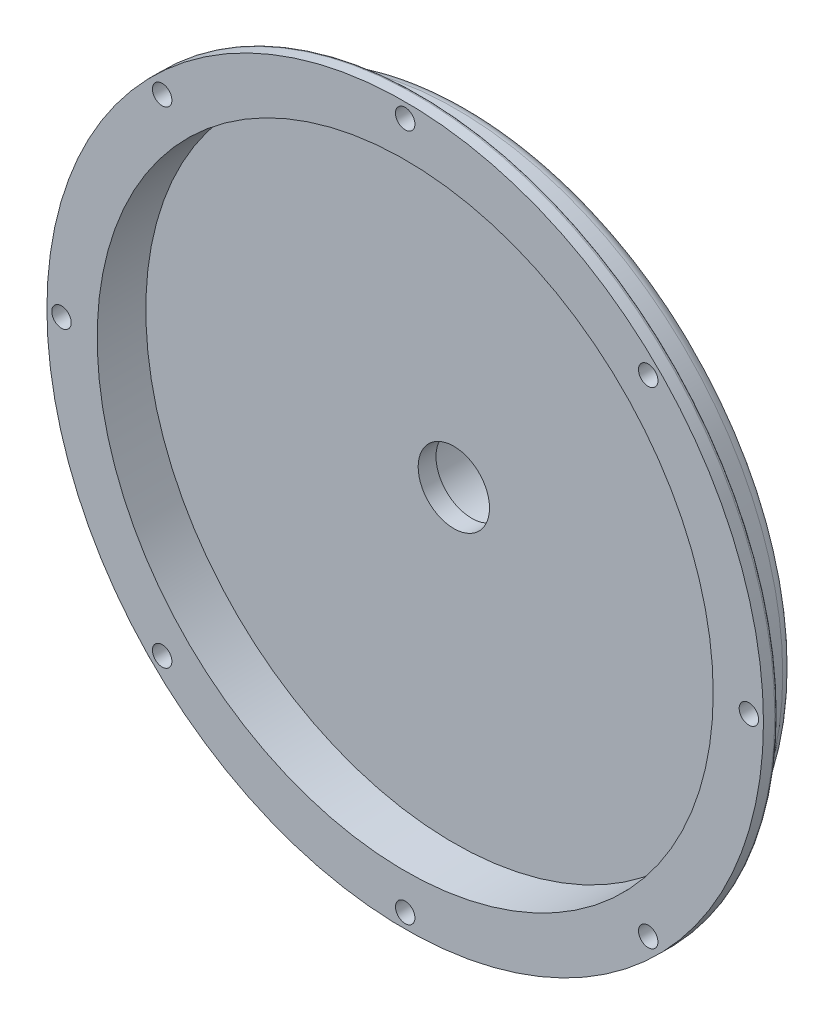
from build123d import *

# Parameters (mm, degrees)
SKETCH_2_R          = 3
CUT_EXTRUDE_1_DEPTH = 10
SKETCH_3_R          = 15
CUT_EXTRUDE_2_DEPTH = 5
EXTRUDE_START       = 14.5
SKETCH_7_R          = 17
SKETCH_7_R_2        = 15
EXTRUDE_1_DEPTH     = 14.5
SKETCH_5_R          = 95
CUT_EXTRUDE_4_DEPTH = 15
SKETCH_6_R          = 11
CUT_EXTRUDE_5_DEPTH = 15
FILLET_1_R          = 1
SKETCH_10_R         = 17.75
SKETCH_10_R_2       = 15.5
EXTRUDE_2_DEPTH     = 13


with BuildPart() as part:
    # Sketch 1 → Revolve 1 (revolve)
    with BuildSketch(Plane(origin=(0, 0, 0), x_dir=(1, 0, 0), z_dir=(0, 1, 0)), mode=Mode.PRIVATE) as revolve_1_sk:
        with BuildLine():
            Line((0, 25.5), (-26.5, 25.5))
            Line((-26.5, 25.5), (-26.5, 22.5))
            ThreePointArc((-26.5, 22.5), (-27.378679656, 20.378679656), (-29.5, 19.5))
            Line((-29.5, 19.5), (-96.637931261, 19.5))
            ThreePointArc((-96.637931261, 19.5), (-99.34998521, 18.440197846), (-100.624918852, 15.822381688))
            Line((-100.624918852, 15.822381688), (-101.46608759, 5.419404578))
            ThreePointArc((-101.46608759, 5.419404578), (-101.784821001, 4.764950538), (-102.462834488, 4.5))
            Line((-102.462834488, 4.5), (-109.5, 4.5))
            ThreePointArc((-109.5, 4.5), (-110.207106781, 4.207106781), (-110.5, 3.5))
            Line((-110.5, 3.5), (-110.5, 0))
            Line((-110.5, 0), (0, 0))
            Line((0, 0), (0, 25.5))
        make_face()
    revolve(revolve_1_sk.sketch.rotate(Axis((0, 0, 0), (0, 0, -1)), 180), axis=Axis((0, 0, 0), (0, 0, -1)))

    # Sketch 2 → Cut-Extrude 1 (cut)
    with BuildSketch(Plane.XY):
        with Locations((0, 106)):
            Circle(SKETCH_2_R)
        with Locations((74.953318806, 74.953318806)):
            Circle(SKETCH_2_R)
        with Locations((106, 0)):
            Circle(SKETCH_2_R)
        with Locations((74.953318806, -74.953318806)):
            Circle(SKETCH_2_R)
        with Locations((0, -106)):
            Circle(SKETCH_2_R)
        with Locations((-74.953318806, -74.953318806)):
            Circle(SKETCH_2_R)
        with Locations((-106, 0)):
            Circle(SKETCH_2_R)
        with Locations((-74.953318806, 74.953318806)):
            Circle(SKETCH_2_R)
    extrude(amount=-CUT_EXTRUDE_1_DEPTH, mode=Mode.SUBTRACT)

    # Sketch 3 → Cut-Extrude 2 (cut)
    with BuildSketch(Plane.XY.offset(-25.5)):
        Circle(SKETCH_3_R)
    extrude(amount=CUT_EXTRUDE_2_DEPTH, mode=Mode.SUBTRACT)

    # Sketch 7 → Extrude 1 (add)
    with BuildSketch(Plane(origin=(0, 0, -25.5), x_dir=(-1, 0, 0), z_dir=(0, 0, -1)).offset(EXTRUDE_START)):
        with Locations(Location((0, 0, 0), (0, 0, 180))):
            Circle(SKETCH_7_R)
        Circle(SKETCH_7_R_2, mode=Mode.SUBTRACT)
    extrude(amount=-EXTRUDE_1_DEPTH)

    # Sketch 5 → Cut-Extrude 4 (cut)
    with BuildSketch(Plane.XY):
        Circle(SKETCH_5_R)
    extrude(amount=-CUT_EXTRUDE_4_DEPTH, mode=Mode.SUBTRACT)

    # Sketch 6 → Cut-Extrude 5 (cut)
    with BuildSketch(Plane(origin=(0, 0, -20.5), x_dir=(-1, 0, 0), z_dir=(0, 0, -1))):
        Circle(SKETCH_6_R)
    extrude(amount=-CUT_EXTRUDE_5_DEPTH, mode=Mode.SUBTRACT)

    # Fillet 1
    fillet_1_edges = [part.edges().sort_by_distance(p)[0] for p in [
        (-26.5, 0, -25.5),
    ]]
    fillet(fillet_1_edges, radius=FILLET_1_R)

    # Sketch 10 → Extrude 2 (add)
    with BuildSketch(Plane(origin=(0, 0, -40), x_dir=(-1, 0, 0), z_dir=(0, 0, -1))):
        Circle(SKETCH_10_R)
        Circle(SKETCH_10_R_2, mode=Mode.SUBTRACT)
    extrude(amount=-EXTRUDE_2_DEPTH)

    # Sketch 15 → Cut-Revolve 1 (revolve, cut)
    with BuildSketch(Plane(origin=(0, 0, 0), x_dir=(0, 0, -1), z_dir=(1, 0, 0)), mode=Mode.PRIVATE) as cut_revolve_1_sk:
        Polygon((38.774646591, 18.035931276), (40.56291486, 15.49108797), (42.144844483, 15.49108797), (42.144844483, 19.342742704), (38.774646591, 19.342742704), align=None)
    revolve(cut_revolve_1_sk.sketch.rotate(Axis((0, 0, -40.685830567), (0, 0, 1)), 90), axis=Axis((0, 0, -40.685830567), (0, 0, 1)), mode=Mode.SUBTRACT)


solid = part.part
